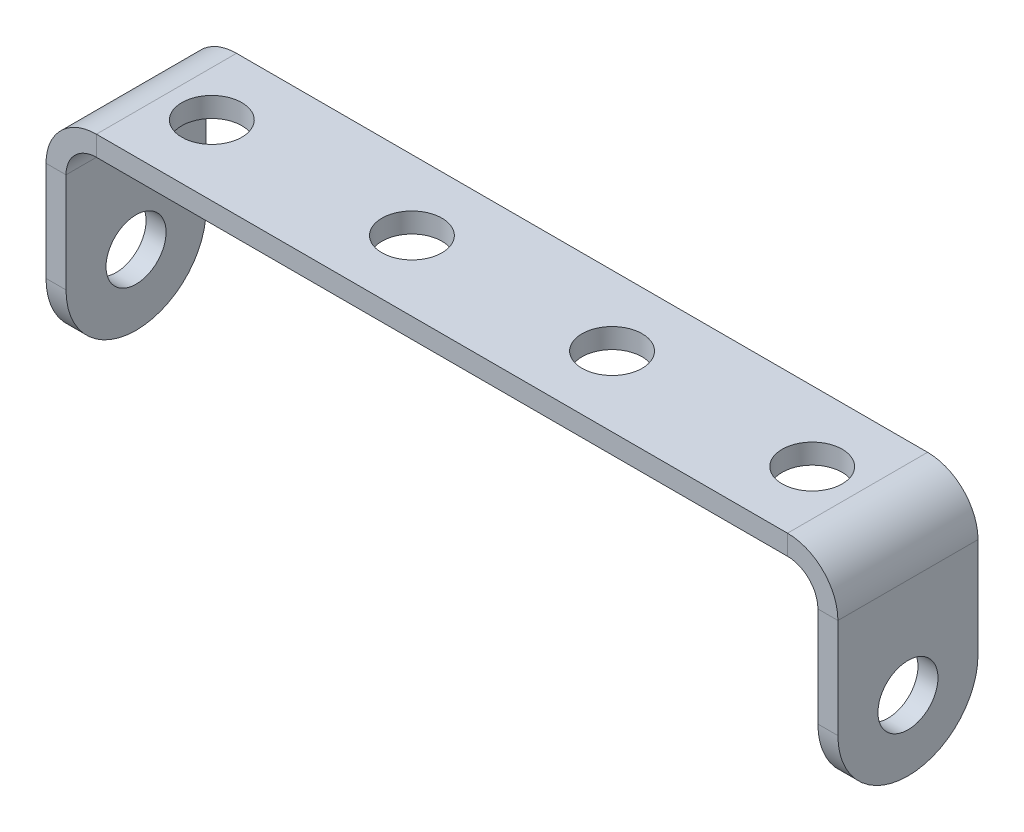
ISO-10303-21;
HEADER;
FILE_DESCRIPTION(('STEP AP214'),'2;1');
FILE_NAME('part.step','',(''),(''),'','','');
FILE_SCHEMA(('AUTOMOTIVE_DESIGN { 1 0 10303 214 1 1 1 1 }'));
ENDSEC;
DATA;
#1=APPLICATION_CONTEXT('core data for automotive mechanical design processes');
#2=APPLICATION_PROTOCOL_DEFINITION('international standard','automotive_design',2000,#1);
#3=PRODUCT_CONTEXT('',#1,'mechanical');
#4=PRODUCT('Part','Part','',(#3));
#5=PRODUCT_RELATED_PRODUCT_CATEGORY('part','',(#4));
#6=PRODUCT_DEFINITION_FORMATION('','',#4);
#7=PRODUCT_DEFINITION_CONTEXT('part definition',#1,'design');
#8=PRODUCT_DEFINITION('design','',#6,#7);
#9=PRODUCT_DEFINITION_SHAPE('','',#8);
#10=(LENGTH_UNIT() NAMED_UNIT(*) SI_UNIT(.MILLI.,.METRE.));
#11=(NAMED_UNIT(*) PLANE_ANGLE_UNIT() SI_UNIT($,.RADIAN.));
#12=(NAMED_UNIT(*) SI_UNIT($,.STERADIAN.) SOLID_ANGLE_UNIT());
#13=UNCERTAINTY_MEASURE_WITH_UNIT(LENGTH_MEASURE(1.E-05),#10,'distance_accuracy_value','');
#14=(GEOMETRIC_REPRESENTATION_CONTEXT(3) GLOBAL_UNCERTAINTY_ASSIGNED_CONTEXT((#13)) GLOBAL_UNIT_ASSIGNED_CONTEXT((#10,
#11,#12)) REPRESENTATION_CONTEXT('',''));
#15=CARTESIAN_POINT('',(0.,0.,0.));
#16=DIRECTION('',(0.,0.,1.));
#17=DIRECTION('',(1.,0.,0.));
#18=AXIS2_PLACEMENT_3D('',#15,#16,#17);
#19=CARTESIAN_POINT('',(18.785,-6.5,0.));
#20=DIRECTION('',(-1.,0.,0.));
#21=DIRECTION('',(0.,0.,1.));
#22=AXIS2_PLACEMENT_3D('',#19,#20,#21);
#23=CYLINDRICAL_SURFACE('',#22,3.5);
#24=DIRECTION('',(-1.,0.,0.));
#25=VECTOR('',#24,1.);
#26=CARTESIAN_POINT('',(17.26608,-6.5,3.5));
#27=LINE('',#26,#25);
#28=CARTESIAN_POINT('',(18.785,-6.5,3.5));
#29=VERTEX_POINT('',#28);
#30=CARTESIAN_POINT('',(19.785,-6.5,3.5));
#31=VERTEX_POINT('',#30);
#32=EDGE_CURVE('E158',#29,#31,#27,.F.);
#33=ORIENTED_EDGE('',*,*,#32,.F.);
#34=CARTESIAN_POINT('',(18.785,-6.5,0.));
#35=DIRECTION('',(1.,0.,0.));
#36=DIRECTION('',(0.,0.,-1.));
#37=AXIS2_PLACEMENT_3D('',#34,#35,#36);
#38=CIRCLE('',#37,3.5);
#39=CARTESIAN_POINT('',(18.785,-6.5,-3.5));
#40=VERTEX_POINT('',#39);
#41=EDGE_CURVE('E49',#40,#29,#38,.F.);
#42=ORIENTED_EDGE('',*,*,#41,.F.);
#43=DIRECTION('',(-1.,0.,0.));
#44=VECTOR('',#43,1.);
#45=CARTESIAN_POINT('',(17.26608,-6.5,-3.5));
#46=LINE('',#45,#44);
#47=CARTESIAN_POINT('',(19.785,-6.5,-3.5));
#48=VERTEX_POINT('',#47);
#49=EDGE_CURVE('E252',#48,#40,#46,.T.);
#50=ORIENTED_EDGE('',*,*,#49,.F.);
#51=CARTESIAN_POINT('',(19.785,-6.5,0.));
#52=DIRECTION('',(1.,0.,0.));
#53=DIRECTION('',(0.,0.,-1.));
#54=AXIS2_PLACEMENT_3D('',#51,#52,#53);
#55=CIRCLE('',#54,3.5);
#56=EDGE_CURVE('E11',#31,#48,#55,.T.);
#57=ORIENTED_EDGE('',*,*,#56,.F.);
#58=EDGE_LOOP('',(#33,#42,#50,#57));
#59=FACE_BOUND('',#58,.T.);
#60=ADVANCED_FACE('F40',(#59),#23,.T.);
#61=CARTESIAN_POINT('',(-18.785,-6.5,0.));
#62=DIRECTION('',(-1.,0.,0.));
#63=DIRECTION('',(0.,0.,1.));
#64=AXIS2_PLACEMENT_3D('',#61,#62,#63);
#65=CYLINDRICAL_SURFACE('',#64,3.5);
#66=DIRECTION('',(1.,0.,0.));
#67=VECTOR('',#66,1.);
#68=CARTESIAN_POINT('',(-18.785,-6.5,-3.5));
#69=LINE('',#68,#67);
#70=CARTESIAN_POINT('',(-18.785,-6.5,-3.5));
#71=VERTEX_POINT('',#70);
#72=CARTESIAN_POINT('',(-19.785,-6.5,-3.5));
#73=VERTEX_POINT('',#72);
#74=EDGE_CURVE('E241',#71,#73,#69,.F.);
#75=ORIENTED_EDGE('',*,*,#74,.F.);
#76=CARTESIAN_POINT('',(-18.785,-6.5,0.));
#77=DIRECTION('',(-1.,0.,0.));
#78=DIRECTION('',(0.,0.,1.));
#79=AXIS2_PLACEMENT_3D('',#76,#77,#78);
#80=CIRCLE('',#79,3.5);
#81=CARTESIAN_POINT('',(-18.785,-6.5,3.5));
#82=VERTEX_POINT('',#81);
#83=EDGE_CURVE('E247',#82,#71,#80,.F.);
#84=ORIENTED_EDGE('',*,*,#83,.F.);
#85=DIRECTION('',(-1.,0.,0.));
#86=VECTOR('',#85,1.);
#87=CARTESIAN_POINT('',(-17.26608,-6.5,3.5));
#88=LINE('',#87,#86);
#89=CARTESIAN_POINT('',(-19.785,-6.5,3.5));
#90=VERTEX_POINT('',#89);
#91=EDGE_CURVE('E244',#90,#82,#88,.F.);
#92=ORIENTED_EDGE('',*,*,#91,.F.);
#93=CARTESIAN_POINT('',(-19.785,-6.5,0.));
#94=DIRECTION('',(-1.,0.,0.));
#95=DIRECTION('',(0.,0.,1.));
#96=AXIS2_PLACEMENT_3D('',#93,#94,#95);
#97=CIRCLE('',#96,3.5);
#98=EDGE_CURVE('E249',#73,#90,#97,.T.);
#99=ORIENTED_EDGE('',*,*,#98,.F.);
#100=EDGE_LOOP('',(#75,#84,#92,#99));
#101=FACE_BOUND('',#100,.T.);
#102=ADVANCED_FACE('F339',(#101),#65,.T.);
#103=CARTESIAN_POINT('',(-18.785,-1.51892,3.5));
#104=DIRECTION('',(0.,0.,1.));
#105=DIRECTION('',(1.,0.,0.));
#106=AXIS2_PLACEMENT_3D('',#103,#104,#105);
#107=PLANE('',#106);
#108=DIRECTION('',(-1.,0.,0.));
#109=VECTOR('',#108,1.);
#110=CARTESIAN_POINT('',(-18.785,-1.51892,3.5));
#111=LINE('',#110,#109);
#112=CARTESIAN_POINT('',(-18.785,-1.51892,3.5));
#113=VERTEX_POINT('',#112);
#114=CARTESIAN_POINT('',(-19.785,-1.51892,3.5));
#115=VERTEX_POINT('',#114);
#116=EDGE_CURVE('E238',#113,#115,#111,.T.);
#117=ORIENTED_EDGE('',*,*,#116,.F.);
#118=CARTESIAN_POINT('',(-17.26608,-1.51892,3.5));
#119=DIRECTION('',(0.,0.,1.));
#120=DIRECTION('',(1.,0.,0.));
#121=AXIS2_PLACEMENT_3D('',#118,#119,#120);
#122=CIRCLE('',#121,1.51892);
#123=CARTESIAN_POINT('',(-17.26608,0.,3.5));
#124=VERTEX_POINT('',#123);
#125=EDGE_CURVE('E176',#113,#124,#122,.F.);
#126=ORIENTED_EDGE('',*,*,#125,.T.);
#127=DIRECTION('',(0.,-1.,0.));
#128=VECTOR('',#127,1.);
#129=CARTESIAN_POINT('',(-17.26608,1.,3.5));
#130=LINE('',#129,#128);
#131=CARTESIAN_POINT('',(-17.26608,1.,3.5));
#132=VERTEX_POINT('',#131);
#133=EDGE_CURVE('E236',#132,#124,#130,.T.);
#134=ORIENTED_EDGE('',*,*,#133,.F.);
#135=CARTESIAN_POINT('',(-17.26608,-1.51892,3.5));
#136=DIRECTION('',(0.,0.,1.));
#137=DIRECTION('',(1.,0.,0.));
#138=AXIS2_PLACEMENT_3D('',#135,#136,#137);
#139=CIRCLE('',#138,2.51892);
#140=EDGE_CURVE('E166',#115,#132,#139,.F.);
#141=ORIENTED_EDGE('',*,*,#140,.F.);
#142=EDGE_LOOP('',(#117,#126,#134,#141));
#143=FACE_BOUND('',#142,.T.);
#144=ADVANCED_FACE('F315',(#143),#107,.T.);
#145=CARTESIAN_POINT('',(-17.26608,1.,3.5));
#146=DIRECTION('',(0.,0.,1.));
#147=DIRECTION('',(1.,0.,0.));
#148=AXIS2_PLACEMENT_3D('',#145,#146,#147);
#149=PLANE('',#148);
#150=DIRECTION('',(0.,1.,0.));
#151=VECTOR('',#150,1.);
#152=CARTESIAN_POINT('',(-19.785,-10.,3.5));
#153=LINE('',#152,#151);
#154=EDGE_CURVE('E172',#90,#115,#153,.T.);
#155=ORIENTED_EDGE('',*,*,#154,.F.);
#156=ORIENTED_EDGE('',*,*,#91,.T.);
#157=DIRECTION('',(0.,1.,0.));
#158=VECTOR('',#157,1.);
#159=CARTESIAN_POINT('',(-18.785,-10.,3.5));
#160=LINE('',#159,#158);
#161=EDGE_CURVE('E174',#82,#113,#160,.T.);
#162=ORIENTED_EDGE('',*,*,#161,.T.);
#163=ORIENTED_EDGE('',*,*,#116,.T.);
#164=EDGE_LOOP('',(#155,#156,#162,#163));
#165=FACE_BOUND('',#164,.T.);
#166=ADVANCED_FACE('F332',(#165),#149,.T.);
#167=CARTESIAN_POINT('',(-17.26608,0.,-3.5));
#168=DIRECTION('',(0.,0.,-1.));
#169=DIRECTION('',(-1.,0.,0.));
#170=AXIS2_PLACEMENT_3D('',#167,#168,#169);
#171=PLANE('',#170);
#172=DIRECTION('',(0.,1.,0.));
#173=VECTOR('',#172,1.);
#174=CARTESIAN_POINT('',(-17.26608,0.,-3.5));
#175=LINE('',#174,#173);
#176=CARTESIAN_POINT('',(-17.26608,0.,-3.5));
#177=VERTEX_POINT('',#176);
#178=CARTESIAN_POINT('',(-17.26608,1.,-3.5));
#179=VERTEX_POINT('',#178);
#180=EDGE_CURVE('E234',#177,#179,#175,.T.);
#181=ORIENTED_EDGE('',*,*,#180,.F.);
#182=CARTESIAN_POINT('',(-17.26608,-1.51892,-3.5));
#183=DIRECTION('',(0.,0.,1.));
#184=DIRECTION('',(1.,0.,0.));
#185=AXIS2_PLACEMENT_3D('',#182,#183,#184);
#186=CIRCLE('',#185,1.51892);
#187=CARTESIAN_POINT('',(-18.785,-1.51892,-3.5));
#188=VERTEX_POINT('',#187);
#189=EDGE_CURVE('E201',#188,#177,#186,.F.);
#190=ORIENTED_EDGE('',*,*,#189,.F.);
#191=DIRECTION('',(1.,0.,0.));
#192=VECTOR('',#191,1.);
#193=CARTESIAN_POINT('',(-19.785,-1.51892,-3.5));
#194=LINE('',#193,#192);
#195=CARTESIAN_POINT('',(-19.785,-1.51892,-3.5));
#196=VERTEX_POINT('',#195);
#197=EDGE_CURVE('E231',#196,#188,#194,.T.);
#198=ORIENTED_EDGE('',*,*,#197,.F.);
#199=CARTESIAN_POINT('',(-17.26608,-1.51892,-3.5));
#200=DIRECTION('',(0.,0.,1.));
#201=DIRECTION('',(1.,0.,0.));
#202=AXIS2_PLACEMENT_3D('',#199,#200,#201);
#203=CIRCLE('',#202,2.51892);
#204=EDGE_CURVE('E194',#196,#179,#203,.F.);
#205=ORIENTED_EDGE('',*,*,#204,.T.);
#206=EDGE_LOOP('',(#181,#190,#198,#205));
#207=FACE_BOUND('',#206,.T.);
#208=ADVANCED_FACE('F323',(#207),#171,.T.);
#209=CARTESIAN_POINT('',(-19.785,-1.51892,-3.5));
#210=DIRECTION('',(0.,0.,-1.));
#211=DIRECTION('',(-1.,0.,0.));
#212=AXIS2_PLACEMENT_3D('',#209,#210,#211);
#213=PLANE('',#212);
#214=DIRECTION('',(1.,0.,0.));
#215=VECTOR('',#214,1.);
#216=CARTESIAN_POINT('',(-18.785,0.,-3.5));
#217=LINE('',#216,#215);
#218=CARTESIAN_POINT('',(17.26608,0.,-3.5));
#219=VERTEX_POINT('',#218);
#220=EDGE_CURVE('E204',#177,#219,#217,.T.);
#221=ORIENTED_EDGE('',*,*,#220,.F.);
#222=ORIENTED_EDGE('',*,*,#180,.T.);
#223=DIRECTION('',(1.,0.,0.));
#224=VECTOR('',#223,1.);
#225=CARTESIAN_POINT('',(-18.785,1.,-3.5));
#226=LINE('',#225,#224);
#227=CARTESIAN_POINT('',(17.26608,1.,-3.5));
#228=VERTEX_POINT('',#227);
#229=EDGE_CURVE('E191',#179,#228,#226,.T.);
#230=ORIENTED_EDGE('',*,*,#229,.T.);
#231=DIRECTION('',(0.,-1.,0.));
#232=VECTOR('',#231,1.);
#233=CARTESIAN_POINT('',(17.26608,1.,-3.5));
#234=LINE('',#233,#232);
#235=EDGE_CURVE('E153',#228,#219,#234,.T.);
#236=ORIENTED_EDGE('',*,*,#235,.T.);
#237=EDGE_LOOP('',(#221,#222,#230,#236));
#238=FACE_BOUND('',#237,.T.);
#239=ADVANCED_FACE('F300',(#238),#213,.T.);
#240=CARTESIAN_POINT('',(17.26608,0.,3.5));
#241=DIRECTION('',(0.,0.,1.));
#242=DIRECTION('',(1.,0.,0.));
#243=AXIS2_PLACEMENT_3D('',#240,#241,#242);
#244=PLANE('',#243);
#245=DIRECTION('',(0.,1.,0.));
#246=VECTOR('',#245,1.);
#247=CARTESIAN_POINT('',(17.26608,0.,3.5));
#248=LINE('',#247,#246);
#249=CARTESIAN_POINT('',(17.26608,0.,3.5));
#250=VERTEX_POINT('',#249);
#251=CARTESIAN_POINT('',(17.26608,1.,3.5));
#252=VERTEX_POINT('',#251);
#253=EDGE_CURVE('E141',#250,#252,#248,.T.);
#254=ORIENTED_EDGE('',*,*,#253,.F.);
#255=CARTESIAN_POINT('',(17.26608,-1.51892,3.5));
#256=DIRECTION('',(0.,0.,1.));
#257=DIRECTION('',(1.,0.,0.));
#258=AXIS2_PLACEMENT_3D('',#255,#256,#257);
#259=CIRCLE('',#258,1.51892);
#260=CARTESIAN_POINT('',(18.785,-1.51892,3.5));
#261=VERTEX_POINT('',#260);
#262=EDGE_CURVE('E136',#250,#261,#259,.F.);
#263=ORIENTED_EDGE('',*,*,#262,.T.);
#264=DIRECTION('',(-1.,0.,0.));
#265=VECTOR('',#264,1.);
#266=CARTESIAN_POINT('',(19.785,-1.51892,3.5));
#267=LINE('',#266,#265);
#268=CARTESIAN_POINT('',(19.785,-1.51892,3.5));
#269=VERTEX_POINT('',#268);
#270=EDGE_CURVE('E129',#269,#261,#267,.T.);
#271=ORIENTED_EDGE('',*,*,#270,.F.);
#272=CARTESIAN_POINT('',(17.26608,-1.51892,3.5));
#273=DIRECTION('',(0.,0.,1.));
#274=DIRECTION('',(1.,0.,0.));
#275=AXIS2_PLACEMENT_3D('',#272,#273,#274);
#276=CIRCLE('',#275,2.51892);
#277=EDGE_CURVE('E133',#252,#269,#276,.F.);
#278=ORIENTED_EDGE('',*,*,#277,.F.);
#279=EDGE_LOOP('',(#254,#263,#271,#278));
#280=FACE_BOUND('',#279,.T.);
#281=ADVANCED_FACE('F131',(#280),#244,.T.);
#282=CARTESIAN_POINT('',(19.785,-1.51892,3.5));
#283=DIRECTION('',(0.,0.,1.));
#284=DIRECTION('',(1.,0.,0.));
#285=AXIS2_PLACEMENT_3D('',#282,#283,#284);
#286=PLANE('',#285);
#287=DIRECTION('',(1.,0.,0.));
#288=VECTOR('',#287,1.);
#289=CARTESIAN_POINT('',(-18.785,0.,3.5));
#290=LINE('',#289,#288);
#291=EDGE_CURVE('E179',#124,#250,#290,.T.);
#292=ORIENTED_EDGE('',*,*,#291,.T.);
#293=ORIENTED_EDGE('',*,*,#253,.T.);
#294=DIRECTION('',(1.,0.,0.));
#295=VECTOR('',#294,1.);
#296=CARTESIAN_POINT('',(-18.785,1.,3.5));
#297=LINE('',#296,#295);
#298=EDGE_CURVE('E164',#132,#252,#297,.T.);
#299=ORIENTED_EDGE('',*,*,#298,.F.);
#300=ORIENTED_EDGE('',*,*,#133,.T.);
#301=EDGE_LOOP('',(#292,#293,#299,#300));
#302=FACE_BOUND('',#301,.T.);
#303=ADVANCED_FACE('F307',(#302),#286,.T.);
#304=CARTESIAN_POINT('',(18.785,-1.51892,-3.5));
#305=DIRECTION('',(0.,0.,-1.));
#306=DIRECTION('',(-1.,0.,0.));
#307=AXIS2_PLACEMENT_3D('',#304,#305,#306);
#308=PLANE('',#307);
#309=DIRECTION('',(1.,0.,0.));
#310=VECTOR('',#309,1.);
#311=CARTESIAN_POINT('',(18.785,-1.51892,-3.5));
#312=LINE('',#311,#310);
#313=CARTESIAN_POINT('',(18.785,-1.51892,-3.5));
#314=VERTEX_POINT('',#313);
#315=CARTESIAN_POINT('',(19.785,-1.51892,-3.5));
#316=VERTEX_POINT('',#315);
#317=EDGE_CURVE('E142',#314,#316,#312,.T.);
#318=ORIENTED_EDGE('',*,*,#317,.F.);
#319=CARTESIAN_POINT('',(17.26608,-1.51892,-3.5));
#320=DIRECTION('',(0.,0.,1.));
#321=DIRECTION('',(1.,0.,0.));
#322=AXIS2_PLACEMENT_3D('',#319,#320,#321);
#323=CIRCLE('',#322,1.51892);
#324=EDGE_CURVE('E207',#219,#314,#323,.F.);
#325=ORIENTED_EDGE('',*,*,#324,.F.);
#326=ORIENTED_EDGE('',*,*,#235,.F.);
#327=CARTESIAN_POINT('',(17.26608,-1.51892,-3.5));
#328=DIRECTION('',(0.,0.,1.));
#329=DIRECTION('',(1.,0.,0.));
#330=AXIS2_PLACEMENT_3D('',#327,#328,#329);
#331=CIRCLE('',#330,2.51892);
#332=EDGE_CURVE('E189',#228,#316,#331,.F.);
#333=ORIENTED_EDGE('',*,*,#332,.T.);
#334=EDGE_LOOP('',(#318,#325,#326,#333));
#335=FACE_BOUND('',#334,.T.);
#336=ADVANCED_FACE('F290',(#335),#308,.T.);
#337=CARTESIAN_POINT('',(17.26608,1.,-3.5));
#338=DIRECTION('',(0.,0.,-1.));
#339=DIRECTION('',(-1.,0.,0.));
#340=AXIS2_PLACEMENT_3D('',#337,#338,#339);
#341=PLANE('',#340);
#342=DIRECTION('',(0.,1.,0.));
#343=VECTOR('',#342,1.);
#344=CARTESIAN_POINT('',(19.785,0.,-3.5));
#345=LINE('',#344,#343);
#346=EDGE_CURVE('E149',#316,#48,#345,.F.);
#347=ORIENTED_EDGE('',*,*,#346,.T.);
#348=ORIENTED_EDGE('',*,*,#49,.T.);
#349=DIRECTION('',(0.,-1.,0.));
#350=VECTOR('',#349,1.);
#351=CARTESIAN_POINT('',(18.785,0.,-3.5));
#352=LINE('',#351,#350);
#353=EDGE_CURVE('E184',#314,#40,#352,.T.);
#354=ORIENTED_EDGE('',*,*,#353,.F.);
#355=ORIENTED_EDGE('',*,*,#317,.T.);
#356=EDGE_LOOP('',(#347,#348,#354,#355));
#357=FACE_BOUND('',#356,.T.);
#358=ADVANCED_FACE('F287',(#357),#341,.T.);
#359=CARTESIAN_POINT('',(18.785,0.,3.5));
#360=DIRECTION('',(1.,0.,0.));
#361=DIRECTION('',(0.,0.,-1.));
#362=AXIS2_PLACEMENT_3D('',#359,#360,#361);
#363=PLANE('',#362);
#364=CARTESIAN_POINT('',(18.785,-6.5,0.));
#365=DIRECTION('',(1.,0.,0.));
#366=DIRECTION('',(0.,0.,-1.));
#367=AXIS2_PLACEMENT_3D('',#364,#365,#366);
#368=CIRCLE('',#367,1.5);
#369=CARTESIAN_POINT('',(18.785,-6.5,-1.5));
#370=VERTEX_POINT('',#369);
#371=EDGE_CURVE('E187',#370,#370,#368,.T.);
#372=ORIENTED_EDGE('',*,*,#371,.T.);
#373=EDGE_LOOP('',(#372));
#374=FACE_BOUND('',#373,.T.);
#375=ORIENTED_EDGE('',*,*,#353,.T.);
#376=ORIENTED_EDGE('',*,*,#41,.T.);
#377=DIRECTION('',(0.,-1.,0.));
#378=VECTOR('',#377,1.);
#379=CARTESIAN_POINT('',(18.785,0.,3.5));
#380=LINE('',#379,#378);
#381=EDGE_CURVE('E159',#261,#29,#380,.T.);
#382=ORIENTED_EDGE('',*,*,#381,.F.);
#383=DIRECTION('',(0.,0.,-1.));
#384=VECTOR('',#383,1.);
#385=CARTESIAN_POINT('',(18.785,-1.51892,3.5));
#386=LINE('',#385,#384);
#387=EDGE_CURVE('E183',#261,#314,#386,.T.);
#388=ORIENTED_EDGE('',*,*,#387,.T.);
#389=EDGE_LOOP('',(#375,#376,#382,#388));
#390=FACE_BOUND('',#389,.T.);
#391=ADVANCED_FACE('F284',(#374,#390),#363,.F.);
#392=CARTESIAN_POINT('',(19.785,0.,3.5));
#393=DIRECTION('',(1.,0.,0.));
#394=DIRECTION('',(0.,0.,-1.));
#395=AXIS2_PLACEMENT_3D('',#392,#393,#394);
#396=PLANE('',#395);
#397=CARTESIAN_POINT('',(19.785,-6.5,0.));
#398=DIRECTION('',(1.,0.,0.));
#399=DIRECTION('',(0.,0.,-1.));
#400=AXIS2_PLACEMENT_3D('',#397,#398,#399);
#401=CIRCLE('',#400,1.5);
#402=CARTESIAN_POINT('',(19.785,-6.5,-1.5));
#403=VERTEX_POINT('',#402);
#404=EDGE_CURVE('E270',#403,#403,#401,.T.);
#405=ORIENTED_EDGE('',*,*,#404,.F.);
#406=EDGE_LOOP('',(#405));
#407=FACE_BOUND('',#406,.T.);
#408=DIRECTION('',(0.,1.,0.));
#409=VECTOR('',#408,1.);
#410=CARTESIAN_POINT('',(19.785,0.,3.5));
#411=LINE('',#410,#409);
#412=EDGE_CURVE('E147',#269,#31,#411,.F.);
#413=ORIENTED_EDGE('',*,*,#412,.T.);
#414=ORIENTED_EDGE('',*,*,#56,.T.);
#415=ORIENTED_EDGE('',*,*,#346,.F.);
#416=DIRECTION('',(0.,0.,-1.));
#417=VECTOR('',#416,1.);
#418=CARTESIAN_POINT('',(19.785,-1.51892,3.5));
#419=LINE('',#418,#417);
#420=EDGE_CURVE('E145',#269,#316,#419,.T.);
#421=ORIENTED_EDGE('',*,*,#420,.F.);
#422=EDGE_LOOP('',(#413,#414,#415,#421));
#423=FACE_BOUND('',#422,.T.);
#424=ADVANCED_FACE('F146',(#407,#423),#396,.T.);
#425=CARTESIAN_POINT('',(17.26608,-1.51892,3.5));
#426=DIRECTION('',(0.,0.,-1.));
#427=DIRECTION('',(-1.,0.,0.));
#428=AXIS2_PLACEMENT_3D('',#425,#426,#427);
#429=CYLINDRICAL_SURFACE('',#428,2.51892);
#430=ORIENTED_EDGE('',*,*,#332,.F.);
#431=DIRECTION('',(0.,0.,-1.));
#432=VECTOR('',#431,1.);
#433=CARTESIAN_POINT('',(17.26608,1.,3.5));
#434=LINE('',#433,#432);
#435=EDGE_CURVE('E154',#252,#228,#434,.T.);
#436=ORIENTED_EDGE('',*,*,#435,.F.);
#437=ORIENTED_EDGE('',*,*,#277,.T.);
#438=ORIENTED_EDGE('',*,*,#420,.T.);
#439=EDGE_LOOP('',(#430,#436,#437,#438));
#440=FACE_BOUND('',#439,.T.);
#441=ADVANCED_FACE('F162',(#440),#429,.T.);
#442=CARTESIAN_POINT('',(-18.785,1.,3.5));
#443=DIRECTION('',(0.,1.,0.));
#444=DIRECTION('',(0.,0.,1.));
#445=AXIS2_PLACEMENT_3D('',#442,#443,#444);
#446=PLANE('',#445);
#447=CARTESIAN_POINT('',(-15.,1.,0.));
#448=DIRECTION('',(0.,1.,0.));
#449=DIRECTION('',(0.,0.,1.));
#450=AXIS2_PLACEMENT_3D('',#447,#448,#449);
#451=CIRCLE('',#450,1.5);
#452=CARTESIAN_POINT('',(-15.,1.,1.5));
#453=VERTEX_POINT('',#452);
#454=EDGE_CURVE('E263',#453,#453,#451,.T.);
#455=ORIENTED_EDGE('',*,*,#454,.F.);
#456=EDGE_LOOP('',(#455));
#457=FACE_BOUND('',#456,.T.);
#458=CARTESIAN_POINT('',(-5.,1.,0.));
#459=DIRECTION('',(0.,1.,0.));
#460=DIRECTION('',(0.,0.,1.));
#461=AXIS2_PLACEMENT_3D('',#458,#459,#460);
#462=CIRCLE('',#461,1.5);
#463=CARTESIAN_POINT('',(-5.,1.,1.5));
#464=VERTEX_POINT('',#463);
#465=EDGE_CURVE('E417',#464,#464,#462,.T.);
#466=ORIENTED_EDGE('',*,*,#465,.F.);
#467=EDGE_LOOP('',(#466));
#468=FACE_BOUND('',#467,.T.);
#469=CARTESIAN_POINT('',(5.,1.,0.));
#470=DIRECTION('',(0.,1.,0.));
#471=DIRECTION('',(0.,0.,-1.));
#472=AXIS2_PLACEMENT_3D('',#469,#470,#471);
#473=CIRCLE('',#472,1.5);
#474=CARTESIAN_POINT('',(5.,1.,-1.5));
#475=VERTEX_POINT('',#474);
#476=EDGE_CURVE('E420',#475,#475,#473,.T.);
#477=ORIENTED_EDGE('',*,*,#476,.F.);
#478=EDGE_LOOP('',(#477));
#479=FACE_BOUND('',#478,.T.);
#480=CARTESIAN_POINT('',(15.,1.,0.));
#481=DIRECTION('',(0.,1.,0.));
#482=DIRECTION('',(0.,0.,-1.));
#483=AXIS2_PLACEMENT_3D('',#480,#481,#482);
#484=CIRCLE('',#483,1.5);
#485=CARTESIAN_POINT('',(15.,1.,-1.5));
#486=VERTEX_POINT('',#485);
#487=EDGE_CURVE('E424',#486,#486,#484,.T.);
#488=ORIENTED_EDGE('',*,*,#487,.F.);
#489=EDGE_LOOP('',(#488));
#490=FACE_BOUND('',#489,.T.);
#491=ORIENTED_EDGE('',*,*,#229,.F.);
#492=DIRECTION('',(0.,0.,-1.));
#493=VECTOR('',#492,1.);
#494=CARTESIAN_POINT('',(-17.26608,1.,3.5));
#495=LINE('',#494,#493);
#496=EDGE_CURVE('E224',#132,#179,#495,.T.);
#497=ORIENTED_EDGE('',*,*,#496,.F.);
#498=ORIENTED_EDGE('',*,*,#298,.T.);
#499=ORIENTED_EDGE('',*,*,#435,.T.);
#500=EDGE_LOOP('',(#491,#497,#498,#499));
#501=FACE_BOUND('',#500,.T.);
#502=ADVANCED_FACE('F303',(#457,#468,#479,#490,#501),#446,.T.);
#503=CARTESIAN_POINT('',(-17.26608,-1.51892,3.5));
#504=DIRECTION('',(0.,0.,-1.));
#505=DIRECTION('',(-1.,0.,0.));
#506=AXIS2_PLACEMENT_3D('',#503,#504,#505);
#507=CYLINDRICAL_SURFACE('',#506,2.51892);
#508=ORIENTED_EDGE('',*,*,#204,.F.);
#509=DIRECTION('',(0.,0.,-1.));
#510=VECTOR('',#509,1.);
#511=CARTESIAN_POINT('',(-19.785,-1.51892,3.5));
#512=LINE('',#511,#510);
#513=EDGE_CURVE('E221',#115,#196,#512,.T.);
#514=ORIENTED_EDGE('',*,*,#513,.F.);
#515=ORIENTED_EDGE('',*,*,#140,.T.);
#516=ORIENTED_EDGE('',*,*,#496,.T.);
#517=EDGE_LOOP('',(#508,#514,#515,#516));
#518=FACE_BOUND('',#517,.T.);
#519=ADVANCED_FACE('F312',(#518),#507,.T.);
#520=CARTESIAN_POINT('',(-19.785,-10.,3.5));
#521=DIRECTION('',(-1.,0.,0.));
#522=DIRECTION('',(0.,0.,1.));
#523=AXIS2_PLACEMENT_3D('',#520,#521,#522);
#524=PLANE('',#523);
#525=CARTESIAN_POINT('',(-19.785,-6.5,0.));
#526=DIRECTION('',(1.,0.,0.));
#527=DIRECTION('',(0.,0.,-1.));
#528=AXIS2_PLACEMENT_3D('',#525,#526,#527);
#529=CIRCLE('',#528,1.5);
#530=CARTESIAN_POINT('',(-19.785,-6.5,-1.5));
#531=VERTEX_POINT('',#530);
#532=EDGE_CURVE('E258',#531,#531,#529,.T.);
#533=ORIENTED_EDGE('',*,*,#532,.T.);
#534=EDGE_LOOP('',(#533));
#535=FACE_BOUND('',#534,.T.);
#536=DIRECTION('',(0.,1.,0.));
#537=VECTOR('',#536,1.);
#538=CARTESIAN_POINT('',(-19.785,-10.,-3.5));
#539=LINE('',#538,#537);
#540=EDGE_CURVE('E197',#73,#196,#539,.T.);
#541=ORIENTED_EDGE('',*,*,#540,.F.);
#542=ORIENTED_EDGE('',*,*,#98,.T.);
#543=ORIENTED_EDGE('',*,*,#154,.T.);
#544=ORIENTED_EDGE('',*,*,#513,.T.);
#545=EDGE_LOOP('',(#541,#542,#543,#544));
#546=FACE_BOUND('',#545,.T.);
#547=ADVANCED_FACE('F328',(#535,#546),#524,.T.);
#548=CARTESIAN_POINT('',(-18.785,-10.,3.5));
#549=DIRECTION('',(-1.,0.,0.));
#550=DIRECTION('',(0.,0.,1.));
#551=AXIS2_PLACEMENT_3D('',#548,#549,#550);
#552=PLANE('',#551);
#553=CARTESIAN_POINT('',(-18.785,-6.5,0.));
#554=DIRECTION('',(-1.,0.,0.));
#555=DIRECTION('',(0.,0.,1.));
#556=AXIS2_PLACEMENT_3D('',#553,#554,#555);
#557=CIRCLE('',#556,1.5);
#558=CARTESIAN_POINT('',(-18.785,-6.5,1.5));
#559=VERTEX_POINT('',#558);
#560=EDGE_CURVE('E255',#559,#559,#557,.T.);
#561=ORIENTED_EDGE('',*,*,#560,.T.);
#562=EDGE_LOOP('',(#561));
#563=FACE_BOUND('',#562,.T.);
#564=ORIENTED_EDGE('',*,*,#161,.F.);
#565=ORIENTED_EDGE('',*,*,#83,.T.);
#566=DIRECTION('',(0.,1.,0.));
#567=VECTOR('',#566,1.);
#568=CARTESIAN_POINT('',(-18.785,-10.,-3.5));
#569=LINE('',#568,#567);
#570=EDGE_CURVE('E199',#71,#188,#569,.T.);
#571=ORIENTED_EDGE('',*,*,#570,.T.);
#572=DIRECTION('',(0.,0.,-1.));
#573=VECTOR('',#572,1.);
#574=CARTESIAN_POINT('',(-18.785,-1.51892,3.5));
#575=LINE('',#574,#573);
#576=EDGE_CURVE('E218',#113,#188,#575,.T.);
#577=ORIENTED_EDGE('',*,*,#576,.F.);
#578=EDGE_LOOP('',(#564,#565,#571,#577));
#579=FACE_BOUND('',#578,.T.);
#580=ADVANCED_FACE('F335',(#563,#579),#552,.F.);
#581=CARTESIAN_POINT('',(-17.26608,-1.51892,3.5));
#582=DIRECTION('',(0.,0.,-1.));
#583=DIRECTION('',(-1.,0.,0.));
#584=AXIS2_PLACEMENT_3D('',#581,#582,#583);
#585=CYLINDRICAL_SURFACE('',#584,1.51892);
#586=ORIENTED_EDGE('',*,*,#189,.T.);
#587=DIRECTION('',(0.,0.,-1.));
#588=VECTOR('',#587,1.);
#589=CARTESIAN_POINT('',(-17.26608,0.,3.5));
#590=LINE('',#589,#588);
#591=EDGE_CURVE('E215',#124,#177,#590,.T.);
#592=ORIENTED_EDGE('',*,*,#591,.F.);
#593=ORIENTED_EDGE('',*,*,#125,.F.);
#594=ORIENTED_EDGE('',*,*,#576,.T.);
#595=EDGE_LOOP('',(#586,#592,#593,#594));
#596=FACE_BOUND('',#595,.T.);
#597=ADVANCED_FACE('F319',(#596),#585,.F.);
#598=CARTESIAN_POINT('',(-18.785,0.,3.5));
#599=DIRECTION('',(0.,1.,0.));
#600=DIRECTION('',(0.,0.,1.));
#601=AXIS2_PLACEMENT_3D('',#598,#599,#600);
#602=PLANE('',#601);
#603=CARTESIAN_POINT('',(-15.,0.,0.));
#604=DIRECTION('',(0.,1.,0.));
#605=DIRECTION('',(0.,0.,1.));
#606=AXIS2_PLACEMENT_3D('',#603,#604,#605);
#607=CIRCLE('',#606,1.5);
#608=CARTESIAN_POINT('',(-15.,0.,1.5));
#609=VERTEX_POINT('',#608);
#610=EDGE_CURVE('E44',#609,#609,#607,.T.);
#611=ORIENTED_EDGE('',*,*,#610,.T.);
#612=EDGE_LOOP('',(#611));
#613=FACE_BOUND('',#612,.T.);
#614=CARTESIAN_POINT('',(-5.,0.,0.));
#615=DIRECTION('',(0.,1.,0.));
#616=DIRECTION('',(0.,0.,1.));
#617=AXIS2_PLACEMENT_3D('',#614,#615,#616);
#618=CIRCLE('',#617,1.5);
#619=CARTESIAN_POINT('',(-5.,0.,1.5));
#620=VERTEX_POINT('',#619);
#621=EDGE_CURVE('E265',#620,#620,#618,.T.);
#622=ORIENTED_EDGE('',*,*,#621,.T.);
#623=EDGE_LOOP('',(#622));
#624=FACE_BOUND('',#623,.T.);
#625=CARTESIAN_POINT('',(5.,0.,0.));
#626=DIRECTION('',(0.,1.,0.));
#627=DIRECTION('',(0.,0.,1.));
#628=AXIS2_PLACEMENT_3D('',#625,#626,#627);
#629=CIRCLE('',#628,1.5);
#630=CARTESIAN_POINT('',(5.,0.,1.5));
#631=VERTEX_POINT('',#630);
#632=EDGE_CURVE('E262',#631,#631,#629,.T.);
#633=ORIENTED_EDGE('',*,*,#632,.T.);
#634=EDGE_LOOP('',(#633));
#635=FACE_BOUND('',#634,.T.);
#636=CARTESIAN_POINT('',(15.,0.,0.));
#637=DIRECTION('',(0.,1.,0.));
#638=DIRECTION('',(0.,0.,1.));
#639=AXIS2_PLACEMENT_3D('',#636,#637,#638);
#640=CIRCLE('',#639,1.5);
#641=CARTESIAN_POINT('',(15.,0.,1.5));
#642=VERTEX_POINT('',#641);
#643=EDGE_CURVE('E259',#642,#642,#640,.T.);
#644=ORIENTED_EDGE('',*,*,#643,.T.);
#645=EDGE_LOOP('',(#644));
#646=FACE_BOUND('',#645,.T.);
#647=ORIENTED_EDGE('',*,*,#220,.T.);
#648=DIRECTION('',(0.,0.,-1.));
#649=VECTOR('',#648,1.);
#650=CARTESIAN_POINT('',(17.26608,0.,3.5));
#651=LINE('',#650,#649);
#652=EDGE_CURVE('E212',#250,#219,#651,.T.);
#653=ORIENTED_EDGE('',*,*,#652,.F.);
#654=ORIENTED_EDGE('',*,*,#291,.F.);
#655=ORIENTED_EDGE('',*,*,#591,.T.);
#656=EDGE_LOOP('',(#647,#653,#654,#655));
#657=FACE_BOUND('',#656,.T.);
#658=ADVANCED_FACE('F296',(#613,#624,#635,#646,#657),#602,.F.);
#659=CARTESIAN_POINT('',(17.26608,-1.51892,3.5));
#660=DIRECTION('',(0.,0.,-1.));
#661=DIRECTION('',(-1.,0.,0.));
#662=AXIS2_PLACEMENT_3D('',#659,#660,#661);
#663=CYLINDRICAL_SURFACE('',#662,1.51892);
#664=ORIENTED_EDGE('',*,*,#324,.T.);
#665=ORIENTED_EDGE('',*,*,#387,.F.);
#666=ORIENTED_EDGE('',*,*,#262,.F.);
#667=ORIENTED_EDGE('',*,*,#652,.T.);
#668=EDGE_LOOP('',(#664,#665,#666,#667));
#669=FACE_BOUND('',#668,.T.);
#670=ADVANCED_FACE('F292',(#669),#663,.F.);
#671=CARTESIAN_POINT('',(17.26608,-1.51892,3.5));
#672=DIRECTION('',(0.,0.,1.));
#673=DIRECTION('',(1.,0.,0.));
#674=AXIS2_PLACEMENT_3D('',#671,#672,#673);
#675=PLANE('',#674);
#676=ORIENTED_EDGE('',*,*,#381,.T.);
#677=ORIENTED_EDGE('',*,*,#32,.T.);
#678=ORIENTED_EDGE('',*,*,#412,.F.);
#679=ORIENTED_EDGE('',*,*,#270,.T.);
#680=EDGE_LOOP('',(#676,#677,#678,#679));
#681=FACE_BOUND('',#680,.T.);
#682=ADVANCED_FACE('F157',(#681),#675,.T.);
#683=CARTESIAN_POINT('',(17.26608,-1.51892,-3.5));
#684=DIRECTION('',(0.,0.,1.));
#685=DIRECTION('',(1.,0.,0.));
#686=AXIS2_PLACEMENT_3D('',#683,#684,#685);
#687=PLANE('',#686);
#688=ORIENTED_EDGE('',*,*,#570,.F.);
#689=ORIENTED_EDGE('',*,*,#74,.T.);
#690=ORIENTED_EDGE('',*,*,#540,.T.);
#691=ORIENTED_EDGE('',*,*,#197,.T.);
#692=EDGE_LOOP('',(#688,#689,#690,#691));
#693=FACE_BOUND('',#692,.T.);
#694=ADVANCED_FACE('F337',(#693),#687,.F.);
#695=CARTESIAN_POINT('',(-19.785,-6.5,0.));
#696=DIRECTION('',(1.,0.,0.));
#697=DIRECTION('',(0.,0.,-1.));
#698=AXIS2_PLACEMENT_3D('',#695,#696,#697);
#699=CYLINDRICAL_SURFACE('',#698,1.5);
#700=ORIENTED_EDGE('',*,*,#532,.F.);
#701=EDGE_LOOP('',(#700));
#702=FACE_BOUND('',#701,.T.);
#703=ORIENTED_EDGE('',*,*,#560,.F.);
#704=EDGE_LOOP('',(#703));
#705=FACE_BOUND('',#704,.T.);
#706=ADVANCED_FACE('F391',(#702,#705),#699,.F.);
#707=ORIENTED_EDGE('',*,*,#404,.T.);
#708=EDGE_LOOP('',(#707));
#709=FACE_BOUND('',#708,.T.);
#710=ORIENTED_EDGE('',*,*,#371,.F.);
#711=EDGE_LOOP('',(#710));
#712=FACE_BOUND('',#711,.T.);
#713=ADVANCED_FACE('F394',(#709,#712),#699,.F.);
#714=CARTESIAN_POINT('',(15.,-9.,0.));
#715=DIRECTION('',(0.,1.,0.));
#716=DIRECTION('',(0.,0.,1.));
#717=AXIS2_PLACEMENT_3D('',#714,#715,#716);
#718=CYLINDRICAL_SURFACE('',#717,1.5);
#719=ORIENTED_EDGE('',*,*,#487,.T.);
#720=EDGE_LOOP('',(#719));
#721=FACE_BOUND('',#720,.T.);
#722=ORIENTED_EDGE('',*,*,#643,.F.);
#723=EDGE_LOOP('',(#722));
#724=FACE_BOUND('',#723,.T.);
#725=ADVANCED_FACE('F397',(#721,#724),#718,.F.);
#726=CARTESIAN_POINT('',(5.,-9.,0.));
#727=DIRECTION('',(0.,1.,0.));
#728=DIRECTION('',(0.,0.,1.));
#729=AXIS2_PLACEMENT_3D('',#726,#727,#728);
#730=CYLINDRICAL_SURFACE('',#729,1.5);
#731=ORIENTED_EDGE('',*,*,#476,.T.);
#732=EDGE_LOOP('',(#731));
#733=FACE_BOUND('',#732,.T.);
#734=ORIENTED_EDGE('',*,*,#632,.F.);
#735=EDGE_LOOP('',(#734));
#736=FACE_BOUND('',#735,.T.);
#737=ADVANCED_FACE('F400',(#733,#736),#730,.F.);
#738=CARTESIAN_POINT('',(-5.,-9.,0.));
#739=DIRECTION('',(0.,1.,0.));
#740=DIRECTION('',(0.,0.,1.));
#741=AXIS2_PLACEMENT_3D('',#738,#739,#740);
#742=CYLINDRICAL_SURFACE('',#741,1.5);
#743=ORIENTED_EDGE('',*,*,#465,.T.);
#744=EDGE_LOOP('',(#743));
#745=FACE_BOUND('',#744,.T.);
#746=ORIENTED_EDGE('',*,*,#621,.F.);
#747=EDGE_LOOP('',(#746));
#748=FACE_BOUND('',#747,.T.);
#749=ADVANCED_FACE('F404',(#745,#748),#742,.F.);
#750=CARTESIAN_POINT('',(-15.,-9.,0.));
#751=DIRECTION('',(0.,1.,0.));
#752=DIRECTION('',(0.,0.,1.));
#753=AXIS2_PLACEMENT_3D('',#750,#751,#752);
#754=CYLINDRICAL_SURFACE('',#753,1.5);
#755=ORIENTED_EDGE('',*,*,#454,.T.);
#756=EDGE_LOOP('',(#755));
#757=FACE_BOUND('',#756,.T.);
#758=ORIENTED_EDGE('',*,*,#610,.F.);
#759=EDGE_LOOP('',(#758));
#760=FACE_BOUND('',#759,.T.);
#761=ADVANCED_FACE('F408',(#757,#760),#754,.F.);
#762=CLOSED_SHELL('',(#60,#102,#144,#166,#208,#239,#281,#303,#336,#358,#391,#424,#441,#502,#519,
#547,#580,#597,#658,#670,#682,#694,#706,#713,#725,#737,#749,#761));
#763=MANIFOLD_SOLID_BREP('B2',#762);
#764=ADVANCED_BREP_SHAPE_REPRESENTATION('',(#18,#763),#14);
#765=SHAPE_DEFINITION_REPRESENTATION(#9,#764);
ENDSEC;
END-ISO-10303-21;
